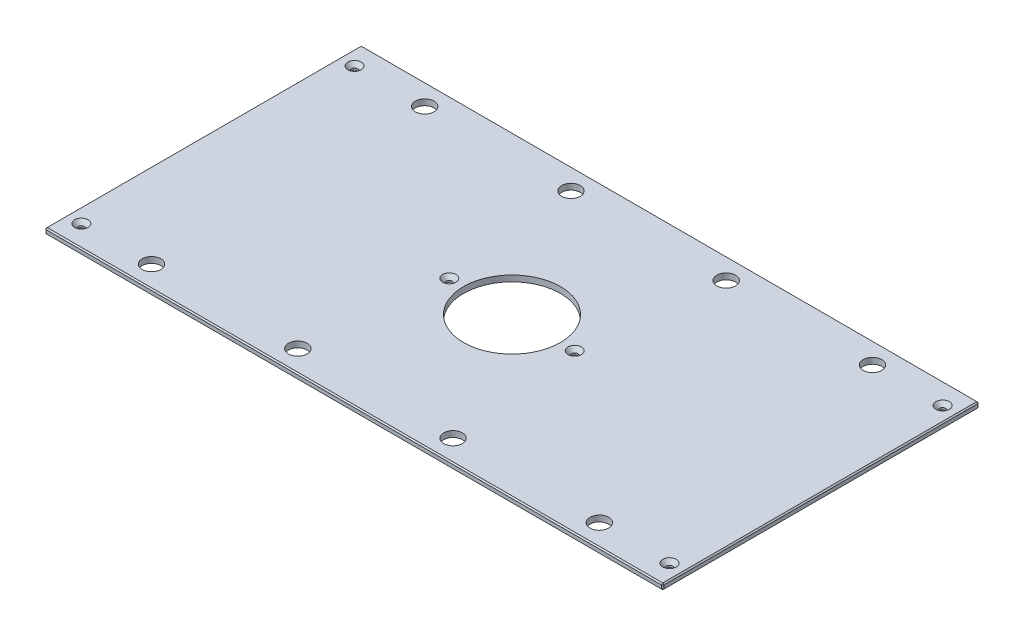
from build123d import *

# Parameters (mm, degrees)
SKETCH1_W                                     = 657.225
SKETCH1_H                                     = 336.55
BOSS_EXTRUDE1_DEPTH                           = 6.35
SKETCH13_R                                    = 51.562
CUT_EXTRUDE6_DEPTH                            = 370.246493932
F_25_32_0_78125_DIAMETER_HOLE1_D              = 19.84375
CHAMFER2_SIZE                                 = 1.27
CSK_FOR_1_4_FLAT_HEAD_MACHINE_SCREW1_AT_COUNT = 2
CSK_FOR_1_4_FLAT_HEAD_MACHINE_SCREW1_AT_PITCH = 290.50996
CSK_FOR_1_4_FLAT_HEAD_MACHINE_SCREW1_2_COUNT  = 2
CSK_FOR_1_4_FLAT_HEAD_MACHINE_SCREW1_2_PITCH  = 689.648470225
CSK_FOR_1_4_FLAT_HEAD_MACHINE_SCREW1_3_COUNT  = 2
CSK_FOR_1_4_FLAT_HEAD_MACHINE_SCREW1_3_PITCH  = 406.266974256
CSK_FOR_1_4_FLAT_HEAD_MACHINE_SCREW1_4_COUNT  = 2
CSK_FOR_1_4_FLAT_HEAD_MACHINE_SCREW1_4_PITCH  = 285.737227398
CSK_FOR_1_4_FLAT_HEAD_MACHINE_SCREW1_5_COUNT  = 2
CSK_FOR_1_4_FLAT_HEAD_MACHINE_SCREW1_5_PITCH  = 625.475
CSK_FOR_1_4_FLAT_HEAD_MACHINE_SCREW1_6_COUNT  = 2
CSK_FOR_1_4_FLAT_HEAD_MACHINE_SCREW1_6_PITCH  = 550.8625
CSK_FOR_1_4_FLAT_HEAD_MACHINE_SCREW1_7_COUNT  = 2
CSK_FOR_1_4_FLAT_HEAD_MACHINE_SCREW1_7_PITCH  = 622.772455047


with BuildPart() as part:
    # Sketch1 → Boss-Extrude1 (new body)
    with BuildSketch(Plane(origin=(0, 0, 0), x_dir=(1, 0, 0), z_dir=(0, 1, 0))):
        Rectangle(SKETCH1_W, SKETCH1_H)
    extrude(amount=BOSS_EXTRUDE1_DEPTH)

    # Sketch13 → Cut-Extrude6 (cut, through all)
    with BuildSketch(Plane(origin=(0, 6.35, 0), x_dir=(1, 0, 0), z_dir=(0, 1, 0))):
        with Locations(Location((0, 0, 0), (0, 0, 270))):
            Circle(SKETCH13_R)
    extrude(amount=-CUT_EXTRUDE6_DEPTH, mode=Mode.SUBTRACT)

    # 25_32 _0.78125_ Diameter Hole1 (through all)
    with Locations(Plane(origin=(0, 6.35, 0), x_dir=(1, 0, 0), z_dir=(0, 1, 0))):
        with Locations((238.125, 145.25498), (-238.125, 145.25498), (238.125, -145.25498), (-238.125, -145.25498), (-82.55, 145.25498), (82.55, 145.25498), (82.55, -145.25498), (-82.55, -145.25498)):
            Hole(F_25_32_0_78125_DIAMETER_HOLE1_D / 2)

    # Chamfer2
    chamfer2_edges = [part.edges().sort_by_distance(p)[0] for p in [
        (328.6125, 6.35, 0),
        (0, 6.35, -168.275),
        (-328.6125, 6.35, 0),
        (0, 0, -168.275),
        (328.6125, 0, 0),
        (0, 0, 168.275),
        (-328.6125, 0, 0),
        (0, 6.35, 168.275),
        (-328.6125, 3.175, -168.275),
        (328.6125, 3.175, -168.275),
        (328.6125, 3.175, 168.275),
        (-328.6125, 3.175, 168.275),
    ]]
    chamfer(chamfer2_edges, length=CHAMFER2_SIZE)

    # Sketch24 → CSK for 1_4 Flat Head Machine Screw1 (revolve, cut)
    with BuildSketch(Plane(origin=(312.7375, 6.35, -145.25498), x_dir=(0, 0, 1), z_dir=(1, 0, 0))):
        Polygon((0, 0), (0, 6.35), (3.3782, 6.35), (3.3782, 4.324464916), (7.1374, 0), align=None)
    csk_for_1_4_flat_head_machine_screw1 = revolve(axis=Axis((312.7375, 12.7, -145.25498), (0, -1, 0)), mode=Mode.SUBTRACT)

    # CSK for 1_4 Flat Head Machine Screw1 at: CSK for 1_4 Flat Head Machine Screw1 ×2
    with Locations(*[(0, 0, i * CSK_FOR_1_4_FLAT_HEAD_MACHINE_SCREW1_AT_PITCH) for i in range(1, CSK_FOR_1_4_FLAT_HEAD_MACHINE_SCREW1_AT_COUNT)]):
        add(csk_for_1_4_flat_head_machine_screw1, mode=Mode.SUBTRACT)

    # CSK for 1_4 Flat Head Machine Screw1 2: CSK for 1_4 Flat Head Machine Screw1 ×2
    with Locations(*[Vector(-0.9069475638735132, 0, 0.42124353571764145) * (i * CSK_FOR_1_4_FLAT_HEAD_MACHINE_SCREW1_2_PITCH) for i in range(1, CSK_FOR_1_4_FLAT_HEAD_MACHINE_SCREW1_2_COUNT)]):
        add(csk_for_1_4_flat_head_machine_screw1, mode=Mode.SUBTRACT)

    # CSK for 1_4 Flat Head Machine Screw1 3: CSK for 1_4 Flat Head Machine Screw1 ×2
    with Locations(*[Vector(-0.9338994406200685, 0, 0.35753578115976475) * (i * CSK_FOR_1_4_FLAT_HEAD_MACHINE_SCREW1_3_PITCH) for i in range(1, CSK_FOR_1_4_FLAT_HEAD_MACHINE_SCREW1_3_COUNT)]):
        add(csk_for_1_4_flat_head_machine_screw1, mode=Mode.SUBTRACT)

    # CSK for 1_4 Flat Head Machine Screw1 4: CSK for 1_4 Flat Head Machine Screw1 ×2
    with Locations(*[Vector(-0.8611496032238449, 0, 0.5083516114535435) * (i * CSK_FOR_1_4_FLAT_HEAD_MACHINE_SCREW1_4_PITCH) for i in range(1, CSK_FOR_1_4_FLAT_HEAD_MACHINE_SCREW1_4_COUNT)]):
        add(csk_for_1_4_flat_head_machine_screw1, mode=Mode.SUBTRACT)

    # CSK for 1_4 Flat Head Machine Screw1 5: CSK for 1_4 Flat Head Machine Screw1 ×2
    with Locations(*[(-i * CSK_FOR_1_4_FLAT_HEAD_MACHINE_SCREW1_5_PITCH, 0, 0) for i in range(1, CSK_FOR_1_4_FLAT_HEAD_MACHINE_SCREW1_5_COUNT)]):
        add(csk_for_1_4_flat_head_machine_screw1, mode=Mode.SUBTRACT)

    # CSK for 1_4 Flat Head Machine Screw1 6: CSK for 1_4 Flat Head Machine Screw1 ×2
    with Locations(*[(-i * CSK_FOR_1_4_FLAT_HEAD_MACHINE_SCREW1_6_PITCH, 0, 0) for i in range(1, CSK_FOR_1_4_FLAT_HEAD_MACHINE_SCREW1_6_COUNT)]):
        add(csk_for_1_4_flat_head_machine_screw1, mode=Mode.SUBTRACT)

    # CSK for 1_4 Flat Head Machine Screw1 7: CSK for 1_4 Flat Head Machine Screw1 ×2
    with Locations(*[Vector(-0.8845325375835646, 0, 0.4664784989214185) * (i * CSK_FOR_1_4_FLAT_HEAD_MACHINE_SCREW1_7_PITCH) for i in range(1, CSK_FOR_1_4_FLAT_HEAD_MACHINE_SCREW1_7_COUNT)]):
        add(csk_for_1_4_flat_head_machine_screw1, mode=Mode.SUBTRACT)


solid = part.part
